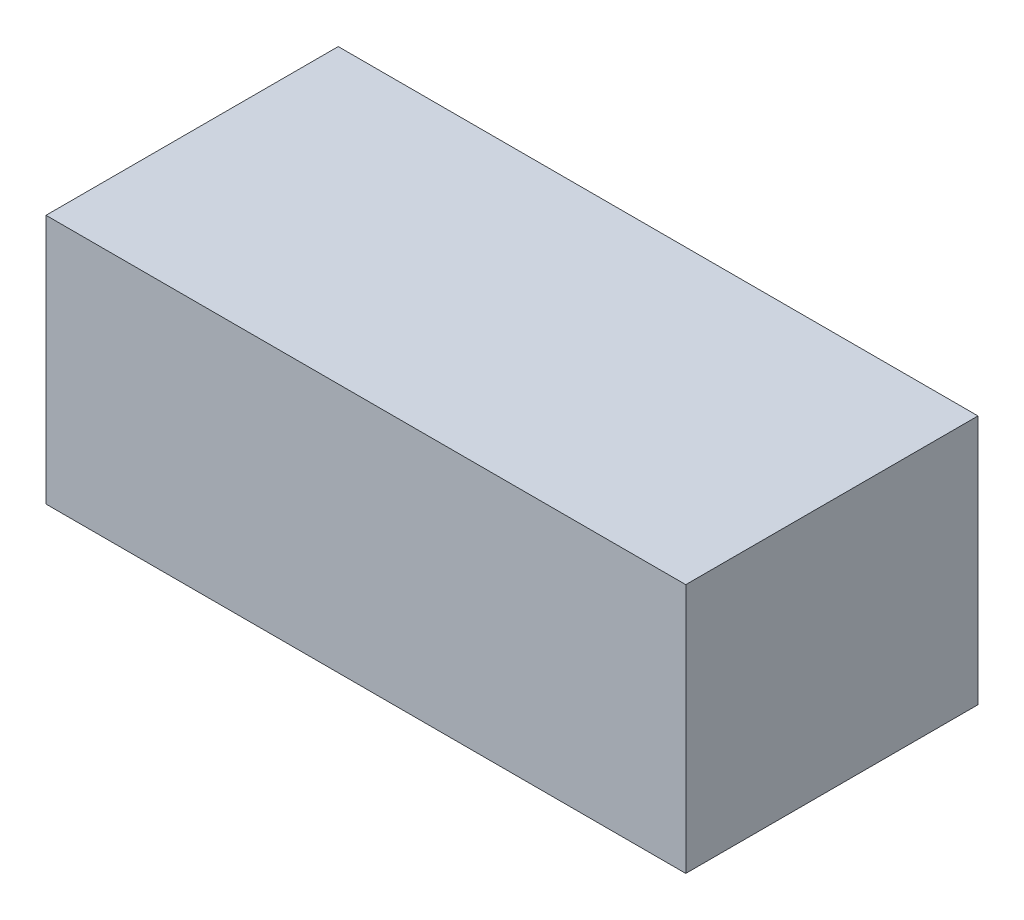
ISO-10303-21;
HEADER;
FILE_DESCRIPTION(('STEP AP214'),'2;1');
FILE_NAME('part.step','',(''),(''),'','','');
FILE_SCHEMA(('AUTOMOTIVE_DESIGN { 1 0 10303 214 1 1 1 1 }'));
ENDSEC;
DATA;
#1=APPLICATION_CONTEXT('core data for automotive mechanical design processes');
#2=APPLICATION_PROTOCOL_DEFINITION('international standard','automotive_design',2000,#1);
#3=PRODUCT_CONTEXT('',#1,'mechanical');
#4=PRODUCT('Part','Part','',(#3));
#5=PRODUCT_RELATED_PRODUCT_CATEGORY('part','',(#4));
#6=PRODUCT_DEFINITION_FORMATION('','',#4);
#7=PRODUCT_DEFINITION_CONTEXT('part definition',#1,'design');
#8=PRODUCT_DEFINITION('design','',#6,#7);
#9=PRODUCT_DEFINITION_SHAPE('','',#8);
#10=(LENGTH_UNIT() NAMED_UNIT(*) SI_UNIT(.MILLI.,.METRE.));
#11=(NAMED_UNIT(*) PLANE_ANGLE_UNIT() SI_UNIT($,.RADIAN.));
#12=(NAMED_UNIT(*) SI_UNIT($,.STERADIAN.) SOLID_ANGLE_UNIT());
#13=UNCERTAINTY_MEASURE_WITH_UNIT(LENGTH_MEASURE(1.E-05),#10,'distance_accuracy_value','');
#14=(GEOMETRIC_REPRESENTATION_CONTEXT(3) GLOBAL_UNCERTAINTY_ASSIGNED_CONTEXT((#13)) GLOBAL_UNIT_ASSIGNED_CONTEXT((#10,
#11,#12)) REPRESENTATION_CONTEXT('',''));
#15=CARTESIAN_POINT('',(0.,0.,0.));
#16=DIRECTION('',(0.,0.,1.));
#17=DIRECTION('',(1.,0.,0.));
#18=AXIS2_PLACEMENT_3D('',#15,#16,#17);
#19=CARTESIAN_POINT('',(0.,9.5,0.));
#20=DIRECTION('',(1.,0.,0.));
#21=DIRECTION('',(0.,0.,-1.));
#22=AXIS2_PLACEMENT_3D('',#19,#20,#21);
#23=PLANE('',#22);
#24=DIRECTION('',(0.,0.,1.));
#25=VECTOR('',#24,1.);
#26=CARTESIAN_POINT('',(0.,0.,0.));
#27=LINE('',#26,#25);
#28=CARTESIAN_POINT('',(0.,0.,-11.1));
#29=VERTEX_POINT('',#28);
#30=CARTESIAN_POINT('',(0.,0.,0.));
#31=VERTEX_POINT('',#30);
#32=EDGE_CURVE('E100',#29,#31,#27,.T.);
#33=ORIENTED_EDGE('',*,*,#32,.T.);
#34=DIRECTION('',(0.,-1.,0.));
#35=VECTOR('',#34,1.);
#36=CARTESIAN_POINT('',(0.,9.5,0.));
#37=LINE('',#36,#35);
#38=CARTESIAN_POINT('',(0.,9.5,0.));
#39=VERTEX_POINT('',#38);
#40=EDGE_CURVE('E11',#39,#31,#37,.T.);
#41=ORIENTED_EDGE('',*,*,#40,.F.);
#42=DIRECTION('',(0.,0.,1.));
#43=VECTOR('',#42,1.);
#44=CARTESIAN_POINT('',(0.,9.5,0.));
#45=LINE('',#44,#43);
#46=CARTESIAN_POINT('',(0.,9.5,-11.1));
#47=VERTEX_POINT('',#46);
#48=EDGE_CURVE('E88',#47,#39,#45,.T.);
#49=ORIENTED_EDGE('',*,*,#48,.F.);
#50=DIRECTION('',(0.,-1.,0.));
#51=VECTOR('',#50,1.);
#52=CARTESIAN_POINT('',(0.,9.5,-11.1));
#53=LINE('',#52,#51);
#54=EDGE_CURVE('E96',#47,#29,#53,.T.);
#55=ORIENTED_EDGE('',*,*,#54,.T.);
#56=EDGE_LOOP('',(#33,#41,#49,#55));
#57=FACE_BOUND('',#56,.T.);
#58=ADVANCED_FACE('F37',(#57),#23,.F.);
#59=CARTESIAN_POINT('',(0.,9.5,0.));
#60=DIRECTION('',(0.,0.,-1.));
#61=DIRECTION('',(-1.,0.,0.));
#62=AXIS2_PLACEMENT_3D('',#59,#60,#61);
#63=PLANE('',#62);
#64=DIRECTION('',(1.,0.,0.));
#65=VECTOR('',#64,1.);
#66=CARTESIAN_POINT('',(0.,0.,0.));
#67=LINE('',#66,#65);
#68=CARTESIAN_POINT('',(24.3,0.,0.));
#69=VERTEX_POINT('',#68);
#70=EDGE_CURVE('E92',#31,#69,#67,.T.);
#71=ORIENTED_EDGE('',*,*,#70,.T.);
#72=DIRECTION('',(0.,-1.,0.));
#73=VECTOR('',#72,1.);
#74=CARTESIAN_POINT('',(24.3,9.5,0.));
#75=LINE('',#74,#73);
#76=CARTESIAN_POINT('',(24.3,9.5,0.));
#77=VERTEX_POINT('',#76);
#78=EDGE_CURVE('E45',#77,#69,#75,.T.);
#79=ORIENTED_EDGE('',*,*,#78,.F.);
#80=DIRECTION('',(1.,0.,0.));
#81=VECTOR('',#80,1.);
#82=CARTESIAN_POINT('',(0.,9.5,0.));
#83=LINE('',#82,#81);
#84=EDGE_CURVE('E83',#39,#77,#83,.T.);
#85=ORIENTED_EDGE('',*,*,#84,.F.);
#86=ORIENTED_EDGE('',*,*,#40,.T.);
#87=EDGE_LOOP('',(#71,#79,#85,#86));
#88=FACE_BOUND('',#87,.T.);
#89=ADVANCED_FACE('F91',(#88),#63,.F.);
#90=CARTESIAN_POINT('',(24.3,9.5,0.));
#91=DIRECTION('',(-1.,0.,0.));
#92=DIRECTION('',(0.,0.,1.));
#93=AXIS2_PLACEMENT_3D('',#90,#91,#92);
#94=PLANE('',#93);
#95=DIRECTION('',(0.,0.,-1.));
#96=VECTOR('',#95,1.);
#97=CARTESIAN_POINT('',(24.3,0.,0.));
#98=LINE('',#97,#96);
#99=CARTESIAN_POINT('',(24.3,0.,-11.1));
#100=VERTEX_POINT('',#99);
#101=EDGE_CURVE('E70',#69,#100,#98,.T.);
#102=ORIENTED_EDGE('',*,*,#101,.T.);
#103=DIRECTION('',(0.,-1.,0.));
#104=VECTOR('',#103,1.);
#105=CARTESIAN_POINT('',(24.3,9.5,-11.1));
#106=LINE('',#105,#104);
#107=CARTESIAN_POINT('',(24.3,9.5,-11.1));
#108=VERTEX_POINT('',#107);
#109=EDGE_CURVE('E93',#108,#100,#106,.T.);
#110=ORIENTED_EDGE('',*,*,#109,.F.);
#111=DIRECTION('',(0.,0.,-1.));
#112=VECTOR('',#111,1.);
#113=CARTESIAN_POINT('',(24.3,9.5,0.));
#114=LINE('',#113,#112);
#115=EDGE_CURVE('E86',#77,#108,#114,.T.);
#116=ORIENTED_EDGE('',*,*,#115,.F.);
#117=ORIENTED_EDGE('',*,*,#78,.T.);
#118=EDGE_LOOP('',(#102,#110,#116,#117));
#119=FACE_BOUND('',#118,.T.);
#120=ADVANCED_FACE('F94',(#119),#94,.F.);
#121=CARTESIAN_POINT('',(0.,9.5,-11.1));
#122=DIRECTION('',(0.,0.,1.));
#123=DIRECTION('',(1.,0.,0.));
#124=AXIS2_PLACEMENT_3D('',#121,#122,#123);
#125=PLANE('',#124);
#126=DIRECTION('',(-1.,0.,0.));
#127=VECTOR('',#126,1.);
#128=CARTESIAN_POINT('',(0.,0.,-11.1));
#129=LINE('',#128,#127);
#130=EDGE_CURVE('E76',#100,#29,#129,.T.);
#131=ORIENTED_EDGE('',*,*,#130,.T.);
#132=ORIENTED_EDGE('',*,*,#54,.F.);
#133=DIRECTION('',(-1.,0.,0.));
#134=VECTOR('',#133,1.);
#135=CARTESIAN_POINT('',(0.,9.5,-11.1));
#136=LINE('',#135,#134);
#137=EDGE_CURVE('E53',#108,#47,#136,.T.);
#138=ORIENTED_EDGE('',*,*,#137,.F.);
#139=ORIENTED_EDGE('',*,*,#109,.T.);
#140=EDGE_LOOP('',(#131,#132,#138,#139));
#141=FACE_BOUND('',#140,.T.);
#142=ADVANCED_FACE('F107',(#141),#125,.F.);
#143=CARTESIAN_POINT('',(0.,9.5,-11.1));
#144=DIRECTION('',(0.,-1.,0.));
#145=DIRECTION('',(0.,0.,-1.));
#146=AXIS2_PLACEMENT_3D('',#143,#144,#145);
#147=PLANE('',#146);
#148=ORIENTED_EDGE('',*,*,#48,.T.);
#149=ORIENTED_EDGE('',*,*,#84,.T.);
#150=ORIENTED_EDGE('',*,*,#115,.T.);
#151=ORIENTED_EDGE('',*,*,#137,.T.);
#152=EDGE_LOOP('',(#148,#149,#150,#151));
#153=FACE_BOUND('',#152,.T.);
#154=ADVANCED_FACE('F84',(#153),#147,.F.);
#155=CARTESIAN_POINT('',(0.,0.,-11.1));
#156=DIRECTION('',(0.,-1.,0.));
#157=DIRECTION('',(0.,0.,-1.));
#158=AXIS2_PLACEMENT_3D('',#155,#156,#157);
#159=PLANE('',#158);
#160=ORIENTED_EDGE('',*,*,#32,.F.);
#161=ORIENTED_EDGE('',*,*,#130,.F.);
#162=ORIENTED_EDGE('',*,*,#101,.F.);
#163=ORIENTED_EDGE('',*,*,#70,.F.);
#164=EDGE_LOOP('',(#160,#161,#162,#163));
#165=FACE_BOUND('',#164,.T.);
#166=ADVANCED_FACE('F110',(#165),#159,.T.);
#167=CLOSED_SHELL('',(#58,#89,#120,#142,#154,#166));
#168=MANIFOLD_SOLID_BREP('B2',#167);
#169=ADVANCED_BREP_SHAPE_REPRESENTATION('',(#18,#168),#14);
#170=SHAPE_DEFINITION_REPRESENTATION(#9,#169);
ENDSEC;
END-ISO-10303-21;
